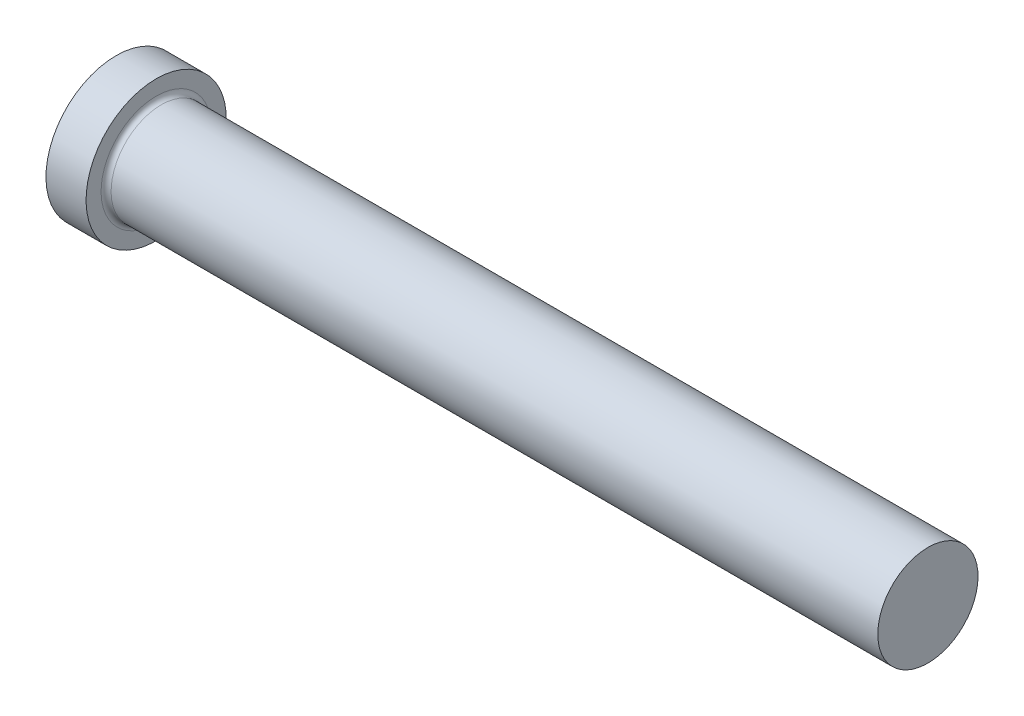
ISO-10303-21;
HEADER;
FILE_DESCRIPTION(('STEP AP214'),'2;1');
FILE_NAME('part.step','',(''),(''),'','','');
FILE_SCHEMA(('AUTOMOTIVE_DESIGN { 1 0 10303 214 1 1 1 1 }'));
ENDSEC;
DATA;
#1=APPLICATION_CONTEXT('core data for automotive mechanical design processes');
#2=APPLICATION_PROTOCOL_DEFINITION('international standard','automotive_design',2000,#1);
#3=PRODUCT_CONTEXT('',#1,'mechanical');
#4=PRODUCT('Part','Part','',(#3));
#5=PRODUCT_RELATED_PRODUCT_CATEGORY('part','',(#4));
#6=PRODUCT_DEFINITION_FORMATION('','',#4);
#7=PRODUCT_DEFINITION_CONTEXT('part definition',#1,'design');
#8=PRODUCT_DEFINITION('design','',#6,#7);
#9=PRODUCT_DEFINITION_SHAPE('','',#8);
#10=(LENGTH_UNIT() NAMED_UNIT(*) SI_UNIT(.MILLI.,.METRE.));
#11=(NAMED_UNIT(*) PLANE_ANGLE_UNIT() SI_UNIT($,.RADIAN.));
#12=(NAMED_UNIT(*) SI_UNIT($,.STERADIAN.) SOLID_ANGLE_UNIT());
#13=UNCERTAINTY_MEASURE_WITH_UNIT(LENGTH_MEASURE(1.E-05),#10,'distance_accuracy_value','');
#14=(GEOMETRIC_REPRESENTATION_CONTEXT(3) GLOBAL_UNCERTAINTY_ASSIGNED_CONTEXT((#13)) GLOBAL_UNIT_ASSIGNED_CONTEXT((#10,
#11,#12)) REPRESENTATION_CONTEXT('',''));
#15=CARTESIAN_POINT('',(0.,0.,0.));
#16=DIRECTION('',(0.,0.,1.));
#17=DIRECTION('',(1.,0.,0.));
#18=AXIS2_PLACEMENT_3D('',#15,#16,#17);
#19=CARTESIAN_POINT('',(122.2375,7.93749999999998,0.));
#20=DIRECTION('',(-1.,0.,0.));
#21=DIRECTION('',(0.,-1.,0.));
#22=AXIS2_PLACEMENT_3D('',#19,#20,#21);
#23=PLANE('',#22);
#24=CARTESIAN_POINT('',(122.2375,0.,0.));
#25=DIRECTION('',(1.,0.,0.));
#26=DIRECTION('',(0.,1.,0.));
#27=AXIS2_PLACEMENT_3D('',#24,#25,#26);
#28=CIRCLE('',#27,7.9375);
#29=CARTESIAN_POINT('',(122.2375,7.93749999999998,0.));
#30=VERTEX_POINT('',#29);
#31=EDGE_CURVE('E10',#30,#30,#28,.T.);
#32=ORIENTED_EDGE('',*,*,#31,.T.);
#33=EDGE_LOOP('',(#32));
#34=FACE_BOUND('',#33,.T.);
#35=ADVANCED_FACE('F30',(#34),#23,.F.);
#36=CARTESIAN_POINT('',(122.2375,0.,0.));
#37=DIRECTION('',(1.,0.,0.));
#38=DIRECTION('',(0.,1.,0.));
#39=AXIS2_PLACEMENT_3D('',#36,#37,#38);
#40=CYLINDRICAL_SURFACE('',#39,7.93749999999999);
#41=ORIENTED_EDGE('',*,*,#31,.F.);
#42=EDGE_LOOP('',(#41));
#43=FACE_BOUND('',#42,.T.);
#44=CARTESIAN_POINT('',(0.793749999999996,0.,0.));
#45=DIRECTION('',(1.,0.,0.));
#46=DIRECTION('',(0.,1.,0.));
#47=AXIS2_PLACEMENT_3D('',#44,#45,#46);
#48=CIRCLE('',#47,7.93749999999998);
#49=CARTESIAN_POINT('',(0.793749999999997,7.93749999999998,0.));
#50=VERTEX_POINT('',#49);
#51=EDGE_CURVE('E36',#50,#50,#48,.T.);
#52=ORIENTED_EDGE('',*,*,#51,.T.);
#53=EDGE_LOOP('',(#52));
#54=FACE_BOUND('',#53,.T.);
#55=ADVANCED_FACE('F65',(#43,#54),#40,.T.);
#56=CARTESIAN_POINT('',(0.793749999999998,0.,0.));
#57=DIRECTION('',(1.,0.,0.));
#58=DIRECTION('',(0.,1.,0.));
#59=AXIS2_PLACEMENT_3D('',#56,#57,#58);
#60=TOROIDAL_SURFACE('',#59,8.73124999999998,0.79375);
#61=ORIENTED_EDGE('',*,*,#51,.F.);
#62=EDGE_LOOP('',(#61));
#63=FACE_BOUND('',#62,.T.);
#64=CARTESIAN_POINT('',(0.,0.,0.));
#65=DIRECTION('',(1.,0.,0.));
#66=DIRECTION('',(0.,1.,0.));
#67=AXIS2_PLACEMENT_3D('',#64,#65,#66);
#68=CIRCLE('',#67,8.73124999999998);
#69=CARTESIAN_POINT('',(0.,8.73124999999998,0.));
#70=VERTEX_POINT('',#69);
#71=EDGE_CURVE('E40',#70,#70,#68,.T.);
#72=ORIENTED_EDGE('',*,*,#71,.T.);
#73=EDGE_LOOP('',(#72));
#74=FACE_BOUND('',#73,.T.);
#75=ADVANCED_FACE('F69',(#63,#74),#60,.F.);
#76=CARTESIAN_POINT('',(0.,11.1125,0.));
#77=DIRECTION('',(-1.,0.,0.));
#78=DIRECTION('',(0.,-1.,0.));
#79=AXIS2_PLACEMENT_3D('',#76,#77,#78);
#80=PLANE('',#79);
#81=ORIENTED_EDGE('',*,*,#71,.F.);
#82=EDGE_LOOP('',(#81));
#83=FACE_BOUND('',#82,.T.);
#84=CARTESIAN_POINT('',(0.,0.,0.));
#85=DIRECTION('',(1.,0.,0.));
#86=DIRECTION('',(0.,1.,0.));
#87=AXIS2_PLACEMENT_3D('',#84,#85,#86);
#88=CIRCLE('',#87,11.1125);
#89=CARTESIAN_POINT('',(0.,11.1125,0.));
#90=VERTEX_POINT('',#89);
#91=EDGE_CURVE('E44',#90,#90,#88,.T.);
#92=ORIENTED_EDGE('',*,*,#91,.T.);
#93=EDGE_LOOP('',(#92));
#94=FACE_BOUND('',#93,.T.);
#95=ADVANCED_FACE('F61',(#83,#94),#80,.F.);
#96=CARTESIAN_POINT('',(122.2375,0.,0.));
#97=DIRECTION('',(1.,0.,0.));
#98=DIRECTION('',(0.,1.,0.));
#99=AXIS2_PLACEMENT_3D('',#96,#97,#98);
#100=CYLINDRICAL_SURFACE('',#99,11.1125);
#101=ORIENTED_EDGE('',*,*,#91,.F.);
#102=EDGE_LOOP('',(#101));
#103=FACE_BOUND('',#102,.T.);
#104=CARTESIAN_POINT('',(-6.34999999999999,0.,0.));
#105=DIRECTION('',(1.,0.,0.));
#106=DIRECTION('',(0.,1.,0.));
#107=AXIS2_PLACEMENT_3D('',#104,#105,#106);
#108=CIRCLE('',#107,11.1125);
#109=CARTESIAN_POINT('',(-6.34999999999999,11.1125,0.));
#110=VERTEX_POINT('',#109);
#111=EDGE_CURVE('E49',#110,#110,#108,.T.);
#112=ORIENTED_EDGE('',*,*,#111,.T.);
#113=EDGE_LOOP('',(#112));
#114=FACE_BOUND('',#113,.T.);
#115=ADVANCED_FACE('F53',(#103,#114),#100,.T.);
#116=CARTESIAN_POINT('',(-6.35,0.,0.));
#117=DIRECTION('',(1.,0.,0.));
#118=DIRECTION('',(0.,1.,0.));
#119=AXIS2_PLACEMENT_3D('',#116,#117,#118);
#120=PLANE('',#119);
#121=ORIENTED_EDGE('',*,*,#111,.F.);
#122=EDGE_LOOP('',(#121));
#123=FACE_BOUND('',#122,.T.);
#124=ADVANCED_FACE('F55',(#123),#120,.F.);
#125=CLOSED_SHELL('',(#35,#55,#75,#95,#115,#124));
#126=MANIFOLD_SOLID_BREP('B2',#125);
#127=ADVANCED_BREP_SHAPE_REPRESENTATION('',(#18,#126),#14);
#128=SHAPE_DEFINITION_REPRESENTATION(#9,#127);
ENDSEC;
END-ISO-10303-21;
